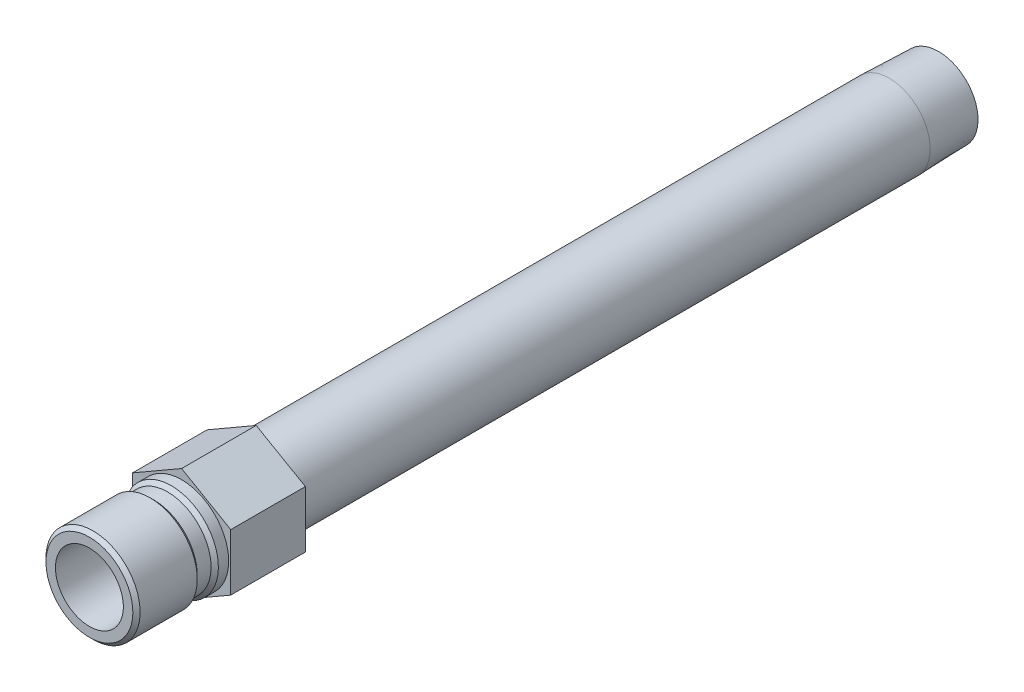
ISO-10303-21;
HEADER;
FILE_DESCRIPTION(('STEP AP214'),'2;1');
FILE_NAME('part.step','',(''),(''),'','','');
FILE_SCHEMA(('AUTOMOTIVE_DESIGN { 1 0 10303 214 1 1 1 1 }'));
ENDSEC;
DATA;
#1=APPLICATION_CONTEXT('core data for automotive mechanical design processes');
#2=APPLICATION_PROTOCOL_DEFINITION('international standard','automotive_design',2000,#1);
#3=PRODUCT_CONTEXT('',#1,'mechanical');
#4=PRODUCT('Part','Part','',(#3));
#5=PRODUCT_RELATED_PRODUCT_CATEGORY('part','',(#4));
#6=PRODUCT_DEFINITION_FORMATION('','',#4);
#7=PRODUCT_DEFINITION_CONTEXT('part definition',#1,'design');
#8=PRODUCT_DEFINITION('design','',#6,#7);
#9=PRODUCT_DEFINITION_SHAPE('','',#8);
#10=(LENGTH_UNIT() NAMED_UNIT(*) SI_UNIT(.MILLI.,.METRE.));
#11=(NAMED_UNIT(*) PLANE_ANGLE_UNIT() SI_UNIT($,.RADIAN.));
#12=(NAMED_UNIT(*) SI_UNIT($,.STERADIAN.) SOLID_ANGLE_UNIT());
#13=UNCERTAINTY_MEASURE_WITH_UNIT(LENGTH_MEASURE(1.E-05),#10,'distance_accuracy_value','');
#14=(GEOMETRIC_REPRESENTATION_CONTEXT(3) GLOBAL_UNCERTAINTY_ASSIGNED_CONTEXT((#13)) GLOBAL_UNIT_ASSIGNED_CONTEXT((#10,
#11,#12)) REPRESENTATION_CONTEXT('',''));
#15=CARTESIAN_POINT('',(0.,0.,0.));
#16=DIRECTION('',(0.,0.,1.));
#17=DIRECTION('',(1.,0.,0.));
#18=AXIS2_PLACEMENT_3D('',#15,#16,#17);
#19=CARTESIAN_POINT('',(0.,0.,0.));
#20=DIRECTION('',(0.,0.,-1.));
#21=DIRECTION('',(0.,1.,0.));
#22=AXIS2_PLACEMENT_3D('',#19,#20,#21);
#23=CYLINDRICAL_SURFACE('',#22,8.5725);
#24=CARTESIAN_POINT('',(0.,0.,-148.1582));
#25=DIRECTION('',(0.,0.,-1.));
#26=DIRECTION('',(0.,1.,0.));
#27=AXIS2_PLACEMENT_3D('',#24,#25,#26);
#28=CIRCLE('',#27,8.5725);
#29=CARTESIAN_POINT('',(0.,8.5725,-148.1582));
#30=VERTEX_POINT('',#29);
#31=EDGE_CURVE('E158',#30,#30,#28,.T.);
#32=ORIENTED_EDGE('',*,*,#31,.F.);
#33=EDGE_LOOP('',(#32));
#34=FACE_BOUND('',#33,.T.);
#35=CARTESIAN_POINT('',(0.,0.,-15.621));
#36=DIRECTION('',(0.,0.,1.));
#37=DIRECTION('',(1.,0.,0.));
#38=AXIS2_PLACEMENT_3D('',#35,#36,#37);
#39=CIRCLE('',#38,8.5725);
#40=CARTESIAN_POINT('',(8.5725,0.,-15.621));
#41=VERTEX_POINT('',#40);
#42=EDGE_CURVE('E39',#41,#41,#39,.F.);
#43=ORIENTED_EDGE('',*,*,#42,.T.);
#44=EDGE_LOOP('',(#43));
#45=FACE_BOUND('',#44,.T.);
#46=ADVANCED_FACE('F35',(#34,#45),#23,.T.);
#47=CARTESIAN_POINT('',(0.,0.,0.));
#48=DIRECTION('',(0.,0.,-1.));
#49=DIRECTION('',(0.,1.,0.));
#50=AXIS2_PLACEMENT_3D('',#47,#48,#49);
#51=CYLINDRICAL_SURFACE('',#50,7.112);
#52=CARTESIAN_POINT('',(0.,0.,1.524));
#53=DIRECTION('',(0.,0.,-1.));
#54=DIRECTION('',(0.,1.,0.));
#55=AXIS2_PLACEMENT_3D('',#52,#53,#54);
#56=CIRCLE('',#55,7.112);
#57=CARTESIAN_POINT('',(0.,7.112,1.524));
#58=VERTEX_POINT('',#57);
#59=EDGE_CURVE('E146',#58,#58,#56,.T.);
#60=ORIENTED_EDGE('',*,*,#59,.T.);
#61=EDGE_LOOP('',(#60));
#62=FACE_BOUND('',#61,.T.);
#63=CARTESIAN_POINT('',(0.,0.,19.304));
#64=DIRECTION('',(0.,0.,-1.));
#65=DIRECTION('',(0.,1.,0.));
#66=AXIS2_PLACEMENT_3D('',#63,#64,#65);
#67=CIRCLE('',#66,7.112);
#68=CARTESIAN_POINT('',(0.,7.112,19.304));
#69=VERTEX_POINT('',#68);
#70=EDGE_CURVE('E11',#69,#69,#67,.T.);
#71=ORIENTED_EDGE('',*,*,#70,.F.);
#72=EDGE_LOOP('',(#71));
#73=FACE_BOUND('',#72,.T.);
#74=ADVANCED_FACE('F37',(#62,#73),#51,.F.);
#75=CARTESIAN_POINT('',(0.,7.112,19.304));
#76=DIRECTION('',(0.,0.,1.));
#77=DIRECTION('',(0.,-1.,0.));
#78=AXIS2_PLACEMENT_3D('',#75,#76,#77);
#79=PLANE('',#78);
#80=ORIENTED_EDGE('',*,*,#70,.T.);
#81=EDGE_LOOP('',(#80));
#82=FACE_BOUND('',#81,.T.);
#83=CARTESIAN_POINT('',(0.,0.,19.304));
#84=DIRECTION('',(0.,0.,-1.));
#85=DIRECTION('',(0.,1.,0.));
#86=AXIS2_PLACEMENT_3D('',#83,#84,#85);
#87=CIRCLE('',#86,9.09319999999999);
#88=CARTESIAN_POINT('',(0.,9.0932,19.304));
#89=VERTEX_POINT('',#88);
#90=EDGE_CURVE('E45',#89,#89,#87,.T.);
#91=ORIENTED_EDGE('',*,*,#90,.F.);
#92=EDGE_LOOP('',(#91));
#93=FACE_BOUND('',#92,.T.);
#94=ADVANCED_FACE('F185',(#82,#93),#79,.T.);
#95=CARTESIAN_POINT('',(0.,0.,18.542));
#96=DIRECTION('',(0.,0.,-1.));
#97=DIRECTION('',(0.,1.,0.));
#98=AXIS2_PLACEMENT_3D('',#95,#96,#97);
#99=CONICAL_SURFACE('',#98,9.8552,0.785398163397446);
#100=ORIENTED_EDGE('',*,*,#90,.T.);
#101=EDGE_LOOP('',(#100));
#102=FACE_BOUND('',#101,.T.);
#103=CARTESIAN_POINT('',(0.,0.,18.542));
#104=DIRECTION('',(0.,0.,-1.));
#105=DIRECTION('',(0.,1.,0.));
#106=AXIS2_PLACEMENT_3D('',#103,#104,#105);
#107=CIRCLE('',#106,9.8552);
#108=CARTESIAN_POINT('',(0.,9.8552,18.542));
#109=VERTEX_POINT('',#108);
#110=EDGE_CURVE('E176',#109,#109,#107,.T.);
#111=ORIENTED_EDGE('',*,*,#110,.F.);
#112=EDGE_LOOP('',(#111));
#113=FACE_BOUND('',#112,.T.);
#114=ADVANCED_FACE('F182',(#102,#113),#99,.T.);
#115=CARTESIAN_POINT('',(0.,0.,0.));
#116=DIRECTION('',(0.,0.,-1.));
#117=DIRECTION('',(0.,1.,0.));
#118=AXIS2_PLACEMENT_3D('',#115,#116,#117);
#119=CYLINDRICAL_SURFACE('',#118,9.8552);
#120=ORIENTED_EDGE('',*,*,#110,.T.);
#121=EDGE_LOOP('',(#120));
#122=FACE_BOUND('',#121,.T.);
#123=CARTESIAN_POINT('',(0.,0.,6.5786));
#124=DIRECTION('',(0.,0.,-1.));
#125=DIRECTION('',(0.,1.,0.));
#126=AXIS2_PLACEMENT_3D('',#123,#124,#125);
#127=CIRCLE('',#126,9.8552);
#128=CARTESIAN_POINT('',(0.,9.8552,6.5786));
#129=VERTEX_POINT('',#128);
#130=EDGE_CURVE('E173',#129,#129,#127,.T.);
#131=ORIENTED_EDGE('',*,*,#130,.F.);
#132=EDGE_LOOP('',(#131));
#133=FACE_BOUND('',#132,.T.);
#134=ADVANCED_FACE('F192',(#122,#133),#119,.T.);
#135=CARTESIAN_POINT('',(0.,0.,5.8166));
#136=DIRECTION('',(0.,0.,1.));
#137=DIRECTION('',(0.,-1.,0.));
#138=AXIS2_PLACEMENT_3D('',#135,#136,#137);
#139=CONICAL_SURFACE('',#138,9.0932,0.785398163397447);
#140=ORIENTED_EDGE('',*,*,#130,.T.);
#141=EDGE_LOOP('',(#140));
#142=FACE_BOUND('',#141,.T.);
#143=CARTESIAN_POINT('',(0.,0.,5.8166));
#144=DIRECTION('',(0.,0.,-1.));
#145=DIRECTION('',(0.,1.,0.));
#146=AXIS2_PLACEMENT_3D('',#143,#144,#145);
#147=CIRCLE('',#146,9.0932);
#148=CARTESIAN_POINT('',(0.,9.0932,5.8166));
#149=VERTEX_POINT('',#148);
#150=EDGE_CURVE('E170',#149,#149,#147,.T.);
#151=ORIENTED_EDGE('',*,*,#150,.F.);
#152=EDGE_LOOP('',(#151));
#153=FACE_BOUND('',#152,.T.);
#154=ADVANCED_FACE('F217',(#142,#153),#139,.T.);
#155=CARTESIAN_POINT('',(0.,0.,0.));
#156=DIRECTION('',(0.,0.,-1.));
#157=DIRECTION('',(0.,1.,0.));
#158=AXIS2_PLACEMENT_3D('',#155,#156,#157);
#159=CYLINDRICAL_SURFACE('',#158,9.0932);
#160=ORIENTED_EDGE('',*,*,#150,.T.);
#161=EDGE_LOOP('',(#160));
#162=FACE_BOUND('',#161,.T.);
#163=CARTESIAN_POINT('',(0.,0.,2.921));
#164=DIRECTION('',(0.,0.,-1.));
#165=DIRECTION('',(0.,1.,0.));
#166=AXIS2_PLACEMENT_3D('',#163,#164,#165);
#167=CIRCLE('',#166,9.0932);
#168=CARTESIAN_POINT('',(0.,9.0932,2.921));
#169=VERTEX_POINT('',#168);
#170=EDGE_CURVE('E167',#169,#169,#167,.T.);
#171=ORIENTED_EDGE('',*,*,#170,.F.);
#172=EDGE_LOOP('',(#171));
#173=FACE_BOUND('',#172,.T.);
#174=ADVANCED_FACE('F213',(#162,#173),#159,.T.);
#175=CARTESIAN_POINT('',(0.,0.,2.159));
#176=DIRECTION('',(0.,0.,-1.));
#177=DIRECTION('',(0.,1.,0.));
#178=AXIS2_PLACEMENT_3D('',#175,#176,#177);
#179=CONICAL_SURFACE('',#178,9.8552,0.785398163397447);
#180=ORIENTED_EDGE('',*,*,#170,.T.);
#181=EDGE_LOOP('',(#180));
#182=FACE_BOUND('',#181,.T.);
#183=CARTESIAN_POINT('',(0.,0.,2.159));
#184=DIRECTION('',(0.,0.,-1.));
#185=DIRECTION('',(0.,1.,0.));
#186=AXIS2_PLACEMENT_3D('',#183,#184,#185);
#187=CIRCLE('',#186,9.8552);
#188=CARTESIAN_POINT('',(0.,9.8552,2.159));
#189=VERTEX_POINT('',#188);
#190=EDGE_CURVE('E164',#189,#189,#187,.T.);
#191=ORIENTED_EDGE('',*,*,#190,.F.);
#192=EDGE_LOOP('',(#191));
#193=FACE_BOUND('',#192,.T.);
#194=ADVANCED_FACE('F209',(#182,#193),#179,.T.);
#195=CARTESIAN_POINT('',(0.,0.,0.));
#196=DIRECTION('',(0.,0.,-1.));
#197=DIRECTION('',(0.,1.,0.));
#198=AXIS2_PLACEMENT_3D('',#195,#196,#197);
#199=CYLINDRICAL_SURFACE('',#198,9.8552);
#200=ORIENTED_EDGE('',*,*,#190,.T.);
#201=EDGE_LOOP('',(#200));
#202=FACE_BOUND('',#201,.T.);
#203=CARTESIAN_POINT('',(0.,0.,0.));
#204=DIRECTION('',(0.,0.,-1.));
#205=DIRECTION('',(0.,1.,0.));
#206=AXIS2_PLACEMENT_3D('',#203,#204,#205);
#207=CIRCLE('',#206,9.8552);
#208=CARTESIAN_POINT('',(0.,9.8552,0.));
#209=VERTEX_POINT('',#208);
#210=EDGE_CURVE('E161',#209,#209,#207,.T.);
#211=ORIENTED_EDGE('',*,*,#210,.F.);
#212=EDGE_LOOP('',(#211));
#213=FACE_BOUND('',#212,.T.);
#214=ADVANCED_FACE('F206',(#202,#213),#199,.T.);
#215=CARTESIAN_POINT('',(0.,0.,-158.496));
#216=DIRECTION('',(0.,0.,1.));
#217=DIRECTION('',(0.,-1.,0.));
#218=AXIS2_PLACEMENT_3D('',#215,#216,#217);
#219=CONICAL_SURFACE('',#218,8.24944566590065,0.0312396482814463);
#220=ORIENTED_EDGE('',*,*,#31,.T.);
#221=EDGE_LOOP('',(#220));
#222=FACE_BOUND('',#221,.T.);
#223=CARTESIAN_POINT('',(0.,0.,-158.496));
#224=DIRECTION('',(0.,0.,-1.));
#225=DIRECTION('',(0.,1.,0.));
#226=AXIS2_PLACEMENT_3D('',#223,#224,#225);
#227=CIRCLE('',#226,8.24944566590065);
#228=CARTESIAN_POINT('',(0.,8.24944566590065,-158.496));
#229=VERTEX_POINT('',#228);
#230=EDGE_CURVE('E155',#229,#229,#227,.T.);
#231=ORIENTED_EDGE('',*,*,#230,.F.);
#232=EDGE_LOOP('',(#231));
#233=FACE_BOUND('',#232,.T.);
#234=ADVANCED_FACE('F204',(#222,#233),#219,.T.);
#235=CARTESIAN_POINT('',(0.,8.24944566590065,-158.496));
#236=DIRECTION('',(0.,0.,-1.));
#237=DIRECTION('',(0.,1.,0.));
#238=AXIS2_PLACEMENT_3D('',#235,#236,#237);
#239=PLANE('',#238);
#240=ORIENTED_EDGE('',*,*,#230,.T.);
#241=EDGE_LOOP('',(#240));
#242=FACE_BOUND('',#241,.T.);
#243=CARTESIAN_POINT('',(0.,0.,-158.496));
#244=DIRECTION('',(0.,0.,-1.));
#245=DIRECTION('',(0.,1.,0.));
#246=AXIS2_PLACEMENT_3D('',#243,#244,#245);
#247=CIRCLE('',#246,6.2611);
#248=CARTESIAN_POINT('',(0.,6.2611,-158.496));
#249=VERTEX_POINT('',#248);
#250=EDGE_CURVE('E152',#249,#249,#247,.T.);
#251=ORIENTED_EDGE('',*,*,#250,.F.);
#252=EDGE_LOOP('',(#251));
#253=FACE_BOUND('',#252,.T.);
#254=ADVANCED_FACE('F270',(#242,#253),#239,.T.);
#255=CARTESIAN_POINT('',(0.,0.,0.));
#256=DIRECTION('',(0.,0.,-1.));
#257=DIRECTION('',(0.,1.,0.));
#258=AXIS2_PLACEMENT_3D('',#255,#256,#257);
#259=CYLINDRICAL_SURFACE('',#258,6.2611);
#260=ORIENTED_EDGE('',*,*,#250,.T.);
#261=EDGE_LOOP('',(#260));
#262=FACE_BOUND('',#261,.T.);
#263=CARTESIAN_POINT('',(0.,0.,1.07156844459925));
#264=DIRECTION('',(0.,0.,-1.));
#265=DIRECTION('',(0.,1.,0.));
#266=AXIS2_PLACEMENT_3D('',#263,#264,#265);
#267=CIRCLE('',#266,6.2611);
#268=CARTESIAN_POINT('',(0.,6.2611,1.07156844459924));
#269=VERTEX_POINT('',#268);
#270=EDGE_CURVE('E149',#269,#269,#267,.T.);
#271=ORIENTED_EDGE('',*,*,#270,.F.);
#272=EDGE_LOOP('',(#271));
#273=FACE_BOUND('',#272,.T.);
#274=ADVANCED_FACE('F267',(#262,#273),#259,.F.);
#275=CARTESIAN_POINT('',(0.,0.,1.524));
#276=DIRECTION('',(0.,0.,1.));
#277=DIRECTION('',(0.,-1.,0.));
#278=AXIS2_PLACEMENT_3D('',#275,#276,#277);
#279=CONICAL_SURFACE('',#278,7.112,1.08210413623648);
#280=ORIENTED_EDGE('',*,*,#270,.T.);
#281=EDGE_LOOP('',(#280));
#282=FACE_BOUND('',#281,.T.);
#283=ORIENTED_EDGE('',*,*,#59,.F.);
#284=EDGE_LOOP('',(#283));
#285=FACE_BOUND('',#284,.T.);
#286=ADVANCED_FACE('F255',(#282,#285),#279,.F.);
#287=CARTESIAN_POINT('',(0.,11.8784044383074,-15.621));
#288=DIRECTION('',(-0.5,0.866025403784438,0.));
#289=DIRECTION('',(-0.866025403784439,-0.5,0.));
#290=AXIS2_PLACEMENT_3D('',#287,#288,#289);
#291=PLANE('',#290);
#292=DIRECTION('',(-0.866025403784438,-0.5,0.));
#293=VECTOR('',#292,1.);
#294=CARTESIAN_POINT('',(0.,11.8784044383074,0.));
#295=LINE('',#294,#293);
#296=CARTESIAN_POINT('',(0.,11.8784044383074,0.));
#297=VERTEX_POINT('',#296);
#298=CARTESIAN_POINT('',(-10.287,5.93920221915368,0.));
#299=VERTEX_POINT('',#298);
#300=EDGE_CURVE('E124',#297,#299,#295,.T.);
#301=ORIENTED_EDGE('',*,*,#300,.F.);
#302=DIRECTION('',(0.,0.,1.));
#303=VECTOR('',#302,1.);
#304=CARTESIAN_POINT('',(0.,11.8784044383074,-15.621));
#305=LINE('',#304,#303);
#306=CARTESIAN_POINT('',(0.,11.8784044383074,-15.621));
#307=VERTEX_POINT('',#306);
#308=EDGE_CURVE('E53',#307,#297,#305,.T.);
#309=ORIENTED_EDGE('',*,*,#308,.F.);
#310=DIRECTION('',(-0.866025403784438,-0.5,0.));
#311=VECTOR('',#310,1.);
#312=CARTESIAN_POINT('',(0.,11.8784044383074,-15.621));
#313=LINE('',#312,#311);
#314=CARTESIAN_POINT('',(-10.287,5.93920221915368,-15.621));
#315=VERTEX_POINT('',#314);
#316=EDGE_CURVE('E139',#307,#315,#313,.T.);
#317=ORIENTED_EDGE('',*,*,#316,.T.);
#318=DIRECTION('',(0.,0.,1.));
#319=VECTOR('',#318,1.);
#320=CARTESIAN_POINT('',(-10.287,5.93920221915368,-15.621));
#321=LINE('',#320,#319);
#322=EDGE_CURVE('E88',#315,#299,#321,.T.);
#323=ORIENTED_EDGE('',*,*,#322,.T.);
#324=EDGE_LOOP('',(#301,#309,#317,#323));
#325=FACE_BOUND('',#324,.T.);
#326=ADVANCED_FACE('F242',(#325),#291,.T.);
#327=CARTESIAN_POINT('',(10.287,5.93920221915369,-15.621));
#328=DIRECTION('',(0.5,0.866025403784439,0.));
#329=DIRECTION('',(-0.866025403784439,0.5,0.));
#330=AXIS2_PLACEMENT_3D('',#327,#328,#329);
#331=PLANE('',#330);
#332=DIRECTION('',(-0.866025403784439,0.5,0.));
#333=VECTOR('',#332,1.);
#334=CARTESIAN_POINT('',(10.287,5.93920221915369,0.));
#335=LINE('',#334,#333);
#336=CARTESIAN_POINT('',(10.287,5.93920221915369,0.));
#337=VERTEX_POINT('',#336);
#338=EDGE_CURVE('E136',#337,#297,#335,.T.);
#339=ORIENTED_EDGE('',*,*,#338,.F.);
#340=DIRECTION('',(0.,0.,1.));
#341=VECTOR('',#340,1.);
#342=CARTESIAN_POINT('',(10.287,5.93920221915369,-15.621));
#343=LINE('',#342,#341);
#344=CARTESIAN_POINT('',(10.287,5.93920221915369,-15.621));
#345=VERTEX_POINT('',#344);
#346=EDGE_CURVE('E76',#345,#337,#343,.T.);
#347=ORIENTED_EDGE('',*,*,#346,.F.);
#348=DIRECTION('',(-0.866025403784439,0.5,0.));
#349=VECTOR('',#348,1.);
#350=CARTESIAN_POINT('',(10.287,5.93920221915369,-15.621));
#351=LINE('',#350,#349);
#352=EDGE_CURVE('E114',#345,#307,#351,.T.);
#353=ORIENTED_EDGE('',*,*,#352,.T.);
#354=ORIENTED_EDGE('',*,*,#308,.T.);
#355=EDGE_LOOP('',(#339,#347,#353,#354));
#356=FACE_BOUND('',#355,.T.);
#357=ADVANCED_FACE('F247',(#356),#331,.T.);
#358=CARTESIAN_POINT('',(10.287,-5.93920221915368,-15.621));
#359=DIRECTION('',(1.,0.,0.));
#360=DIRECTION('',(0.,0.,-1.));
#361=AXIS2_PLACEMENT_3D('',#358,#359,#360);
#362=PLANE('',#361);
#363=DIRECTION('',(0.,1.,0.));
#364=VECTOR('',#363,1.);
#365=CARTESIAN_POINT('',(10.287,-5.93920221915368,0.));
#366=LINE('',#365,#364);
#367=CARTESIAN_POINT('',(10.287,-5.93920221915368,0.));
#368=VERTEX_POINT('',#367);
#369=EDGE_CURVE('E101',#368,#337,#366,.T.);
#370=ORIENTED_EDGE('',*,*,#369,.F.);
#371=DIRECTION('',(0.,0.,1.));
#372=VECTOR('',#371,1.);
#373=CARTESIAN_POINT('',(10.287,-5.93920221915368,-15.621));
#374=LINE('',#373,#372);
#375=CARTESIAN_POINT('',(10.287,-5.93920221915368,-15.621));
#376=VERTEX_POINT('',#375);
#377=EDGE_CURVE('E96',#376,#368,#374,.T.);
#378=ORIENTED_EDGE('',*,*,#377,.F.);
#379=DIRECTION('',(0.,1.,0.));
#380=VECTOR('',#379,1.);
#381=CARTESIAN_POINT('',(10.287,-5.93920221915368,-15.621));
#382=LINE('',#381,#380);
#383=EDGE_CURVE('E99',#376,#345,#382,.T.);
#384=ORIENTED_EDGE('',*,*,#383,.T.);
#385=ORIENTED_EDGE('',*,*,#346,.T.);
#386=EDGE_LOOP('',(#370,#378,#384,#385));
#387=FACE_BOUND('',#386,.T.);
#388=ADVANCED_FACE('F98',(#387),#362,.T.);
#389=CARTESIAN_POINT('',(0.,-11.8784044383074,-15.621));
#390=DIRECTION('',(0.5,-0.866025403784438,0.));
#391=DIRECTION('',(0.866025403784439,0.5,0.));
#392=AXIS2_PLACEMENT_3D('',#389,#390,#391);
#393=PLANE('',#392);
#394=DIRECTION('',(0.866025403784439,0.5,0.));
#395=VECTOR('',#394,1.);
#396=CARTESIAN_POINT('',(0.,-11.8784044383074,0.));
#397=LINE('',#396,#395);
#398=CARTESIAN_POINT('',(0.,-11.8784044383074,0.));
#399=VERTEX_POINT('',#398);
#400=EDGE_CURVE('E133',#399,#368,#397,.T.);
#401=ORIENTED_EDGE('',*,*,#400,.F.);
#402=DIRECTION('',(0.,0.,1.));
#403=VECTOR('',#402,1.);
#404=CARTESIAN_POINT('',(0.,-11.8784044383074,-15.621));
#405=LINE('',#404,#403);
#406=CARTESIAN_POINT('',(0.,-11.8784044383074,-15.621));
#407=VERTEX_POINT('',#406);
#408=EDGE_CURVE('E106',#407,#399,#405,.T.);
#409=ORIENTED_EDGE('',*,*,#408,.F.);
#410=DIRECTION('',(0.866025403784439,0.5,0.));
#411=VECTOR('',#410,1.);
#412=CARTESIAN_POINT('',(0.,-11.8784044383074,-15.621));
#413=LINE('',#412,#411);
#414=EDGE_CURVE('E112',#407,#376,#413,.T.);
#415=ORIENTED_EDGE('',*,*,#414,.T.);
#416=ORIENTED_EDGE('',*,*,#377,.T.);
#417=EDGE_LOOP('',(#401,#409,#415,#416));
#418=FACE_BOUND('',#417,.T.);
#419=ADVANCED_FACE('F116',(#418),#393,.T.);
#420=CARTESIAN_POINT('',(-10.287,-5.93920221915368,-15.621));
#421=DIRECTION('',(-0.5,-0.866025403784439,0.));
#422=DIRECTION('',(0.866025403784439,-0.5,0.));
#423=AXIS2_PLACEMENT_3D('',#420,#421,#422);
#424=PLANE('',#423);
#425=DIRECTION('',(0.866025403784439,-0.5,0.));
#426=VECTOR('',#425,1.);
#427=CARTESIAN_POINT('',(-10.287,-5.93920221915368,0.));
#428=LINE('',#427,#426);
#429=CARTESIAN_POINT('',(-10.287,-5.93920221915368,0.));
#430=VERTEX_POINT('',#429);
#431=EDGE_CURVE('E130',#430,#399,#428,.T.);
#432=ORIENTED_EDGE('',*,*,#431,.F.);
#433=DIRECTION('',(0.,0.,1.));
#434=VECTOR('',#433,1.);
#435=CARTESIAN_POINT('',(-10.287,-5.93920221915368,-15.621));
#436=LINE('',#435,#434);
#437=CARTESIAN_POINT('',(-10.287,-5.93920221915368,-15.621));
#438=VERTEX_POINT('',#437);
#439=EDGE_CURVE('E143',#438,#430,#436,.T.);
#440=ORIENTED_EDGE('',*,*,#439,.F.);
#441=DIRECTION('',(0.866025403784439,-0.5,0.));
#442=VECTOR('',#441,1.);
#443=CARTESIAN_POINT('',(-10.287,-5.93920221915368,-15.621));
#444=LINE('',#443,#442);
#445=EDGE_CURVE('E117',#438,#407,#444,.T.);
#446=ORIENTED_EDGE('',*,*,#445,.T.);
#447=ORIENTED_EDGE('',*,*,#408,.T.);
#448=EDGE_LOOP('',(#432,#440,#446,#447));
#449=FACE_BOUND('',#448,.T.);
#450=ADVANCED_FACE('F246',(#449),#424,.T.);
#451=CARTESIAN_POINT('',(-10.287,5.93920221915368,-15.621));
#452=DIRECTION('',(-1.,0.,0.));
#453=DIRECTION('',(0.,0.,1.));
#454=AXIS2_PLACEMENT_3D('',#451,#452,#453);
#455=PLANE('',#454);
#456=DIRECTION('',(0.,-1.,0.));
#457=VECTOR('',#456,1.);
#458=CARTESIAN_POINT('',(-10.287,5.93920221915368,0.));
#459=LINE('',#458,#457);
#460=EDGE_CURVE('E127',#299,#430,#459,.T.);
#461=ORIENTED_EDGE('',*,*,#460,.F.);
#462=ORIENTED_EDGE('',*,*,#322,.F.);
#463=DIRECTION('',(0.,-1.,0.));
#464=VECTOR('',#463,1.);
#465=CARTESIAN_POINT('',(-10.287,5.93920221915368,-15.621));
#466=LINE('',#465,#464);
#467=EDGE_CURVE('E119',#315,#438,#466,.T.);
#468=ORIENTED_EDGE('',*,*,#467,.T.);
#469=ORIENTED_EDGE('',*,*,#439,.T.);
#470=EDGE_LOOP('',(#461,#462,#468,#469));
#471=FACE_BOUND('',#470,.T.);
#472=ADVANCED_FACE('F243',(#471),#455,.T.);
#473=CARTESIAN_POINT('',(-10.287,5.93920221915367,-15.621));
#474=DIRECTION('',(0.,0.,1.));
#475=DIRECTION('',(1.,0.,0.));
#476=AXIS2_PLACEMENT_3D('',#473,#474,#475);
#477=PLANE('',#476);
#478=ORIENTED_EDGE('',*,*,#42,.F.);
#479=EDGE_LOOP('',(#478));
#480=FACE_BOUND('',#479,.T.);
#481=ORIENTED_EDGE('',*,*,#316,.F.);
#482=ORIENTED_EDGE('',*,*,#352,.F.);
#483=ORIENTED_EDGE('',*,*,#383,.F.);
#484=ORIENTED_EDGE('',*,*,#414,.F.);
#485=ORIENTED_EDGE('',*,*,#445,.F.);
#486=ORIENTED_EDGE('',*,*,#467,.F.);
#487=EDGE_LOOP('',(#481,#482,#483,#484,#485,#486));
#488=FACE_BOUND('',#487,.T.);
#489=ADVANCED_FACE('F110',(#480,#488),#477,.F.);
#490=CARTESIAN_POINT('',(-10.287,5.93920221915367,0.));
#491=DIRECTION('',(0.,0.,1.));
#492=DIRECTION('',(1.,0.,0.));
#493=AXIS2_PLACEMENT_3D('',#490,#491,#492);
#494=PLANE('',#493);
#495=ORIENTED_EDGE('',*,*,#210,.T.);
#496=EDGE_LOOP('',(#495));
#497=FACE_BOUND('',#496,.T.);
#498=ORIENTED_EDGE('',*,*,#300,.T.);
#499=ORIENTED_EDGE('',*,*,#460,.T.);
#500=ORIENTED_EDGE('',*,*,#431,.T.);
#501=ORIENTED_EDGE('',*,*,#400,.T.);
#502=ORIENTED_EDGE('',*,*,#369,.T.);
#503=ORIENTED_EDGE('',*,*,#338,.T.);
#504=EDGE_LOOP('',(#498,#499,#500,#501,#502,#503));
#505=FACE_BOUND('',#504,.T.);
#506=ADVANCED_FACE('F238',(#497,#505),#494,.T.);
#507=CLOSED_SHELL('',(#46,#74,#94,#114,#134,#154,#174,#194,#214,#234,#254,#274,#286,#326,#357,
#388,#419,#450,#472,#489,#506));
#508=MANIFOLD_SOLID_BREP('B2',#507);
#509=ADVANCED_BREP_SHAPE_REPRESENTATION('',(#18,#508),#14);
#510=SHAPE_DEFINITION_REPRESENTATION(#9,#509);
ENDSEC;
END-ISO-10303-21;
